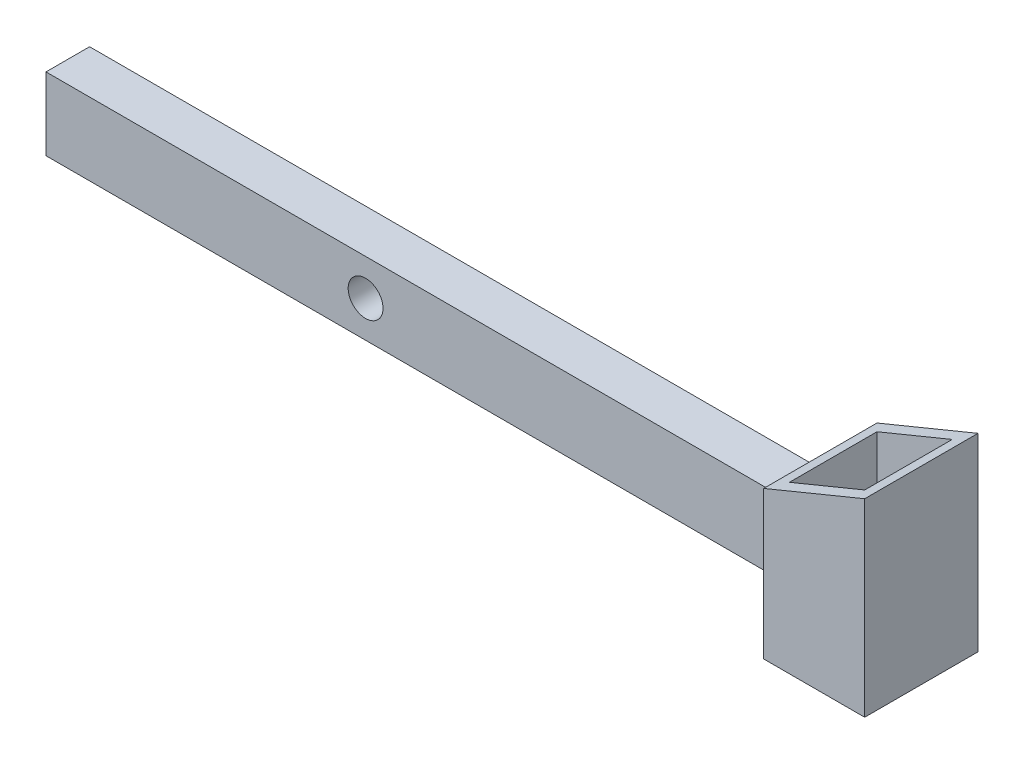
ISO-10303-21;
HEADER;
FILE_DESCRIPTION(('STEP AP214'),'2;1');
FILE_NAME('part.step','',(''),(''),'','','');
FILE_SCHEMA(('AUTOMOTIVE_DESIGN { 1 0 10303 214 1 1 1 1 }'));
ENDSEC;
DATA;
#1=APPLICATION_CONTEXT('core data for automotive mechanical design processes');
#2=APPLICATION_PROTOCOL_DEFINITION('international standard','automotive_design',2000,#1);
#3=PRODUCT_CONTEXT('',#1,'mechanical');
#4=PRODUCT('Part','Part','',(#3));
#5=PRODUCT_RELATED_PRODUCT_CATEGORY('part','',(#4));
#6=PRODUCT_DEFINITION_FORMATION('','',#4);
#7=PRODUCT_DEFINITION_CONTEXT('part definition',#1,'design');
#8=PRODUCT_DEFINITION('design','',#6,#7);
#9=PRODUCT_DEFINITION_SHAPE('','',#8);
#10=(LENGTH_UNIT() NAMED_UNIT(*) SI_UNIT(.MILLI.,.METRE.));
#11=(NAMED_UNIT(*) PLANE_ANGLE_UNIT() SI_UNIT($,.RADIAN.));
#12=(NAMED_UNIT(*) SI_UNIT($,.STERADIAN.) SOLID_ANGLE_UNIT());
#13=UNCERTAINTY_MEASURE_WITH_UNIT(LENGTH_MEASURE(1.E-05),#10,'distance_accuracy_value','');
#14=(GEOMETRIC_REPRESENTATION_CONTEXT(3) GLOBAL_UNCERTAINTY_ASSIGNED_CONTEXT((#13)) GLOBAL_UNIT_ASSIGNED_CONTEXT((#10,
#11,#12)) REPRESENTATION_CONTEXT('',''));
#15=CARTESIAN_POINT('',(0.,0.,0.));
#16=DIRECTION('',(0.,0.,1.));
#17=DIRECTION('',(1.,0.,0.));
#18=AXIS2_PLACEMENT_3D('',#15,#16,#17);
#19=CARTESIAN_POINT('',(-150.,25.985336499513,5.));
#20=DIRECTION('',(0.,0.,1.));
#21=DIRECTION('',(1.,0.,0.));
#22=AXIS2_PLACEMENT_3D('',#19,#20,#21);
#23=CYLINDRICAL_SURFACE('',#22,6.00000000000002);
#24=CARTESIAN_POINT('',(-150.,25.985336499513,25.));
#25=DIRECTION('',(0.,0.,1.));
#26=DIRECTION('',(1.,0.,0.));
#27=AXIS2_PLACEMENT_3D('',#24,#25,#26);
#28=CIRCLE('',#27,6.00000000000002);
#29=CARTESIAN_POINT('',(-144.,25.985336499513,25.));
#30=VERTEX_POINT('',#29);
#31=EDGE_CURVE('E433',#30,#30,#28,.T.);
#32=ORIENTED_EDGE('',*,*,#31,.T.);
#33=EDGE_LOOP('',(#32));
#34=FACE_BOUND('',#33,.T.);
#35=CARTESIAN_POINT('',(-150.,25.985336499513,15.));
#36=DIRECTION('',(0.,0.,-1.));
#37=DIRECTION('',(0.,1.,0.));
#38=AXIS2_PLACEMENT_3D('',#35,#36,#37);
#39=CIRCLE('',#38,6.00000000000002);
#40=CARTESIAN_POINT('',(-150.,31.985336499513,15.));
#41=VERTEX_POINT('',#40);
#42=EDGE_CURVE('E41',#41,#41,#39,.F.);
#43=ORIENTED_EDGE('',*,*,#42,.F.);
#44=EDGE_LOOP('',(#43));
#45=FACE_BOUND('',#44,.T.);
#46=ADVANCED_FACE('F37',(#34,#45),#23,.F.);
#47=CARTESIAN_POINT('',(0.,0.,-0.999999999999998));
#48=DIRECTION('',(-1.,0.,0.));
#49=DIRECTION('',(0.,0.,1.));
#50=AXIS2_PLACEMENT_3D('',#47,#48,#49);
#51=PLANE('',#50);
#52=DIRECTION('',(0.,-1.,0.));
#53=VECTOR('',#52,1.);
#54=CARTESIAN_POINT('',(0.,38.485336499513,10.));
#55=LINE('',#54,#53);
#56=CARTESIAN_POINT('',(0.,38.485336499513,10.));
#57=VERTEX_POINT('',#56);
#58=CARTESIAN_POINT('',(0.,13.485336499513,10.));
#59=VERTEX_POINT('',#58);
#60=EDGE_CURVE('E54',#57,#59,#55,.T.);
#61=ORIENTED_EDGE('',*,*,#60,.F.);
#62=DIRECTION('',(0.,0.,-1.));
#63=VECTOR('',#62,1.);
#64=CARTESIAN_POINT('',(0.,38.485336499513,10.));
#65=LINE('',#64,#63);
#66=CARTESIAN_POINT('',(0.,38.485336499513,25.));
#67=VERTEX_POINT('',#66);
#68=EDGE_CURVE('E58',#67,#57,#65,.T.);
#69=ORIENTED_EDGE('',*,*,#68,.F.);
#70=DIRECTION('',(0.,1.,0.));
#71=VECTOR('',#70,1.);
#72=CARTESIAN_POINT('',(0.,38.485336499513,25.));
#73=LINE('',#72,#71);
#74=CARTESIAN_POINT('',(0.,13.485336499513,25.));
#75=VERTEX_POINT('',#74);
#76=EDGE_CURVE('E447',#75,#67,#73,.T.);
#77=ORIENTED_EDGE('',*,*,#76,.F.);
#78=DIRECTION('',(0.,0.,1.));
#79=VECTOR('',#78,1.);
#80=CARTESIAN_POINT('',(0.,13.485336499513,10.));
#81=LINE('',#80,#79);
#82=EDGE_CURVE('E445',#59,#75,#81,.T.);
#83=ORIENTED_EDGE('',*,*,#82,.F.);
#84=EDGE_LOOP('',(#61,#69,#77,#83));
#85=FACE_BOUND('',#84,.T.);
#86=DIRECTION('',(0.,0.,1.));
#87=VECTOR('',#86,1.);
#88=CARTESIAN_POINT('',(0.,0.,-0.999999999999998));
#89=LINE('',#88,#87);
#90=CARTESIAN_POINT('',(0.,0.,-0.999999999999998));
#91=VERTEX_POINT('',#90);
#92=CARTESIAN_POINT('',(0.,0.,38.));
#93=VERTEX_POINT('',#92);
#94=EDGE_CURVE('E206',#91,#93,#89,.T.);
#95=ORIENTED_EDGE('',*,*,#94,.T.);
#96=DIRECTION('',(0.,-1.,0.));
#97=VECTOR('',#96,1.);
#98=CARTESIAN_POINT('',(0.,0.,38.));
#99=LINE('',#98,#97);
#100=CARTESIAN_POINT('',(0.,50.8308240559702,38.));
#101=VERTEX_POINT('',#100);
#102=EDGE_CURVE('E177',#101,#93,#99,.T.);
#103=ORIENTED_EDGE('',*,*,#102,.F.);
#104=DIRECTION('',(0.,0.,1.));
#105=VECTOR('',#104,1.);
#106=CARTESIAN_POINT('',(0.,50.8308240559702,-0.999999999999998));
#107=LINE('',#106,#105);
#108=CARTESIAN_POINT('',(0.,50.8308240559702,-0.999999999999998));
#109=VERTEX_POINT('',#108);
#110=EDGE_CURVE('E11',#109,#101,#107,.T.);
#111=ORIENTED_EDGE('',*,*,#110,.F.);
#112=DIRECTION('',(0.,-1.,0.));
#113=VECTOR('',#112,1.);
#114=CARTESIAN_POINT('',(0.,0.,-0.999999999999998));
#115=LINE('',#114,#113);
#116=EDGE_CURVE('E195',#109,#91,#115,.T.);
#117=ORIENTED_EDGE('',*,*,#116,.T.);
#118=EDGE_LOOP('',(#95,#103,#111,#117));
#119=FACE_BOUND('',#118,.T.);
#120=ADVANCED_FACE('F39',(#85,#119),#51,.T.);
#121=CARTESIAN_POINT('',(0.,50.8308240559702,-0.999999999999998));
#122=DIRECTION('',(-0.380607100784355,0.924736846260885,0.));
#123=DIRECTION('',(-0.924736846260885,-0.380607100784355,0.));
#124=AXIS2_PLACEMENT_3D('',#121,#122,#123);
#125=PLANE('',#124);
#126=DIRECTION('',(0.,0.,1.));
#127=VECTOR('',#126,1.);
#128=CARTESIAN_POINT('',(4.42934661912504,52.6538732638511,-0.999999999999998));
#129=LINE('',#128,#127);
#130=CARTESIAN_POINT('',(4.42934661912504,52.6538732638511,3.42934661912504));
#131=VERTEX_POINT('',#130);
#132=CARTESIAN_POINT('',(4.42934661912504,52.6538732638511,33.5706533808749));
#133=VERTEX_POINT('',#132);
#134=EDGE_CURVE('E175',#131,#133,#129,.T.);
#135=ORIENTED_EDGE('',*,*,#134,.F.);
#136=DIRECTION('',(-0.924736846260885,-0.380607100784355,0.));
#137=VECTOR('',#136,1.);
#138=CARTESIAN_POINT('',(0.,50.8308240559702,3.42934661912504));
#139=LINE('',#138,#137);
#140=CARTESIAN_POINT('',(30.3397418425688,63.3181832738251,3.42934661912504));
#141=VERTEX_POINT('',#140);
#142=EDGE_CURVE('E158',#141,#131,#139,.T.);
#143=ORIENTED_EDGE('',*,*,#142,.F.);
#144=DIRECTION('',(0.,0.,1.));
#145=VECTOR('',#144,1.);
#146=CARTESIAN_POINT('',(30.3397418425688,63.3181832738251,-0.999999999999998));
#147=LINE('',#146,#145);
#148=CARTESIAN_POINT('',(30.3397418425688,63.3181832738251,33.5706533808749));
#149=VERTEX_POINT('',#148);
#150=EDGE_CURVE('E166',#141,#149,#147,.T.);
#151=ORIENTED_EDGE('',*,*,#150,.T.);
#152=DIRECTION('',(-0.924736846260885,-0.380607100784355,0.));
#153=VECTOR('',#152,1.);
#154=CARTESIAN_POINT('',(0.,50.8308240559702,33.5706533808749));
#155=LINE('',#154,#153);
#156=EDGE_CURVE('E164',#149,#133,#155,.T.);
#157=ORIENTED_EDGE('',*,*,#156,.T.);
#158=EDGE_LOOP('',(#135,#143,#151,#157));
#159=FACE_BOUND('',#158,.T.);
#160=ORIENTED_EDGE('',*,*,#110,.T.);
#161=DIRECTION('',(-0.924736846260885,-0.380607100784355,0.));
#162=VECTOR('',#161,1.);
#163=CARTESIAN_POINT('',(0.,50.8308240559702,38.));
#164=LINE('',#163,#162);
#165=CARTESIAN_POINT('',(34.7690884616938,65.1412324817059,38.));
#166=VERTEX_POINT('',#165);
#167=EDGE_CURVE('E192',#166,#101,#164,.T.);
#168=ORIENTED_EDGE('',*,*,#167,.F.);
#169=DIRECTION('',(0.,0.,1.));
#170=VECTOR('',#169,1.);
#171=CARTESIAN_POINT('',(34.7690884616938,65.1412324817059,-0.999999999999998));
#172=LINE('',#171,#170);
#173=CARTESIAN_POINT('',(34.7690884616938,65.1412324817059,-0.999999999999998));
#174=VERTEX_POINT('',#173);
#175=EDGE_CURVE('E46',#174,#166,#172,.T.);
#176=ORIENTED_EDGE('',*,*,#175,.F.);
#177=DIRECTION('',(-0.924736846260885,-0.380607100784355,0.));
#178=VECTOR('',#177,1.);
#179=CARTESIAN_POINT('',(0.,50.8308240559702,-0.999999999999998));
#180=LINE('',#179,#178);
#181=EDGE_CURVE('E204',#174,#109,#180,.T.);
#182=ORIENTED_EDGE('',*,*,#181,.T.);
#183=EDGE_LOOP('',(#160,#168,#176,#182));
#184=FACE_BOUND('',#183,.T.);
#185=ADVANCED_FACE('F222',(#159,#184),#125,.T.);
#186=CARTESIAN_POINT('',(34.7690884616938,0.,-0.999999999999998));
#187=DIRECTION('',(1.,0.,0.));
#188=DIRECTION('',(0.,0.,-1.));
#189=AXIS2_PLACEMENT_3D('',#186,#187,#188);
#190=PLANE('',#189);
#191=ORIENTED_EDGE('',*,*,#175,.T.);
#192=DIRECTION('',(0.,1.,0.));
#193=VECTOR('',#192,1.);
#194=CARTESIAN_POINT('',(34.7690884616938,0.,38.));
#195=LINE('',#194,#193);
#196=CARTESIAN_POINT('',(34.7690884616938,0.,38.));
#197=VERTEX_POINT('',#196);
#198=EDGE_CURVE('E189',#197,#166,#195,.T.);
#199=ORIENTED_EDGE('',*,*,#198,.F.);
#200=DIRECTION('',(0.,0.,1.));
#201=VECTOR('',#200,1.);
#202=CARTESIAN_POINT('',(34.7690884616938,0.,-0.999999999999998));
#203=LINE('',#202,#201);
#204=CARTESIAN_POINT('',(34.7690884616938,0.,-0.999999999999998));
#205=VERTEX_POINT('',#204);
#206=EDGE_CURVE('E209',#205,#197,#203,.T.);
#207=ORIENTED_EDGE('',*,*,#206,.F.);
#208=DIRECTION('',(0.,1.,0.));
#209=VECTOR('',#208,1.);
#210=CARTESIAN_POINT('',(34.7690884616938,0.,-0.999999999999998));
#211=LINE('',#210,#209);
#212=EDGE_CURVE('E201',#205,#174,#211,.T.);
#213=ORIENTED_EDGE('',*,*,#212,.T.);
#214=EDGE_LOOP('',(#191,#199,#207,#213));
#215=FACE_BOUND('',#214,.T.);
#216=ADVANCED_FACE('F228',(#215),#190,.T.);
#217=CARTESIAN_POINT('',(0.,0.,-0.999999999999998));
#218=DIRECTION('',(0.,-1.,0.));
#219=DIRECTION('',(0.,0.,-1.));
#220=AXIS2_PLACEMENT_3D('',#217,#218,#219);
#221=PLANE('',#220);
#222=ORIENTED_EDGE('',*,*,#206,.T.);
#223=DIRECTION('',(1.,0.,0.));
#224=VECTOR('',#223,1.);
#225=CARTESIAN_POINT('',(0.,0.,38.));
#226=LINE('',#225,#224);
#227=EDGE_CURVE('E186',#93,#197,#226,.T.);
#228=ORIENTED_EDGE('',*,*,#227,.F.);
#229=ORIENTED_EDGE('',*,*,#94,.F.);
#230=DIRECTION('',(1.,0.,0.));
#231=VECTOR('',#230,1.);
#232=CARTESIAN_POINT('',(0.,0.,-0.999999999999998));
#233=LINE('',#232,#231);
#234=EDGE_CURVE('E198',#91,#205,#233,.T.);
#235=ORIENTED_EDGE('',*,*,#234,.T.);
#236=EDGE_LOOP('',(#222,#228,#229,#235));
#237=FACE_BOUND('',#236,.T.);
#238=ADVANCED_FACE('F216',(#237),#221,.T.);
#239=CARTESIAN_POINT('',(0.,0.,-0.999999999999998));
#240=DIRECTION('',(0.,0.,-1.));
#241=DIRECTION('',(-1.,0.,0.));
#242=AXIS2_PLACEMENT_3D('',#239,#240,#241);
#243=PLANE('',#242);
#244=ORIENTED_EDGE('',*,*,#116,.F.);
#245=ORIENTED_EDGE('',*,*,#181,.F.);
#246=ORIENTED_EDGE('',*,*,#212,.F.);
#247=ORIENTED_EDGE('',*,*,#234,.F.);
#248=EDGE_LOOP('',(#244,#245,#246,#247));
#249=FACE_BOUND('',#248,.T.);
#250=ADVANCED_FACE('F225',(#249),#243,.T.);
#251=CARTESIAN_POINT('',(0.,0.,38.));
#252=DIRECTION('',(0.,0.,-1.));
#253=DIRECTION('',(-1.,0.,0.));
#254=AXIS2_PLACEMENT_3D('',#251,#252,#253);
#255=PLANE('',#254);
#256=ORIENTED_EDGE('',*,*,#102,.T.);
#257=ORIENTED_EDGE('',*,*,#227,.T.);
#258=ORIENTED_EDGE('',*,*,#198,.T.);
#259=ORIENTED_EDGE('',*,*,#167,.T.);
#260=EDGE_LOOP('',(#256,#257,#258,#259));
#261=FACE_BOUND('',#260,.T.);
#262=ADVANCED_FACE('F219',(#261),#255,.F.);
#263=CARTESIAN_POINT('',(4.42934661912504,0.,-0.999999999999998));
#264=DIRECTION('',(-1.,0.,0.));
#265=DIRECTION('',(0.,0.,1.));
#266=AXIS2_PLACEMENT_3D('',#263,#264,#265);
#267=PLANE('',#266);
#268=DIRECTION('',(0.,0.,1.));
#269=VECTOR('',#268,1.);
#270=CARTESIAN_POINT('',(4.42934661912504,4.42934661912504,-0.999999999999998));
#271=LINE('',#270,#269);
#272=CARTESIAN_POINT('',(4.42934661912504,4.42934661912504,3.42934661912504));
#273=VERTEX_POINT('',#272);
#274=CARTESIAN_POINT('',(4.42934661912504,4.42934661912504,33.5706533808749));
#275=VERTEX_POINT('',#274);
#276=EDGE_CURVE('E156',#273,#275,#271,.T.);
#277=ORIENTED_EDGE('',*,*,#276,.F.);
#278=DIRECTION('',(0.,-1.,0.));
#279=VECTOR('',#278,1.);
#280=CARTESIAN_POINT('',(4.42934661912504,0.,3.42934661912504));
#281=LINE('',#280,#279);
#282=EDGE_CURVE('E160',#131,#273,#281,.T.);
#283=ORIENTED_EDGE('',*,*,#282,.F.);
#284=ORIENTED_EDGE('',*,*,#134,.T.);
#285=DIRECTION('',(0.,-1.,0.));
#286=VECTOR('',#285,1.);
#287=CARTESIAN_POINT('',(4.42934661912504,0.,33.5706533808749));
#288=LINE('',#287,#286);
#289=EDGE_CURVE('E147',#133,#275,#288,.T.);
#290=ORIENTED_EDGE('',*,*,#289,.T.);
#291=EDGE_LOOP('',(#277,#283,#284,#290));
#292=FACE_BOUND('',#291,.T.);
#293=ADVANCED_FACE('F275',(#292),#267,.F.);
#294=CARTESIAN_POINT('',(30.3397418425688,0.,-0.999999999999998));
#295=DIRECTION('',(1.,0.,0.));
#296=DIRECTION('',(0.,0.,-1.));
#297=AXIS2_PLACEMENT_3D('',#294,#295,#296);
#298=PLANE('',#297);
#299=ORIENTED_EDGE('',*,*,#150,.F.);
#300=DIRECTION('',(0.,1.,0.));
#301=VECTOR('',#300,1.);
#302=CARTESIAN_POINT('',(30.3397418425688,0.,3.42934661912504));
#303=LINE('',#302,#301);
#304=CARTESIAN_POINT('',(30.3397418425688,4.42934661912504,3.42934661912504));
#305=VERTEX_POINT('',#304);
#306=EDGE_CURVE('E172',#305,#141,#303,.T.);
#307=ORIENTED_EDGE('',*,*,#306,.F.);
#308=DIRECTION('',(0.,0.,1.));
#309=VECTOR('',#308,1.);
#310=CARTESIAN_POINT('',(30.3397418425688,4.42934661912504,-0.999999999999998));
#311=LINE('',#310,#309);
#312=CARTESIAN_POINT('',(30.3397418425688,4.42934661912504,33.5706533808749));
#313=VERTEX_POINT('',#312);
#314=EDGE_CURVE('E157',#305,#313,#311,.T.);
#315=ORIENTED_EDGE('',*,*,#314,.T.);
#316=DIRECTION('',(0.,1.,0.));
#317=VECTOR('',#316,1.);
#318=CARTESIAN_POINT('',(30.3397418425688,0.,33.5706533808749));
#319=LINE('',#318,#317);
#320=EDGE_CURVE('E169',#313,#149,#319,.T.);
#321=ORIENTED_EDGE('',*,*,#320,.T.);
#322=EDGE_LOOP('',(#299,#307,#315,#321));
#323=FACE_BOUND('',#322,.T.);
#324=ADVANCED_FACE('F278',(#323),#298,.F.);
#325=CARTESIAN_POINT('',(0.,4.42934661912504,-0.999999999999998));
#326=DIRECTION('',(0.,-1.,0.));
#327=DIRECTION('',(0.,0.,-1.));
#328=AXIS2_PLACEMENT_3D('',#325,#326,#327);
#329=PLANE('',#328);
#330=ORIENTED_EDGE('',*,*,#314,.F.);
#331=DIRECTION('',(1.,0.,0.));
#332=VECTOR('',#331,1.);
#333=CARTESIAN_POINT('',(0.,4.42934661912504,3.42934661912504));
#334=LINE('',#333,#332);
#335=EDGE_CURVE('E163',#273,#305,#334,.T.);
#336=ORIENTED_EDGE('',*,*,#335,.F.);
#337=ORIENTED_EDGE('',*,*,#276,.T.);
#338=DIRECTION('',(1.,0.,0.));
#339=VECTOR('',#338,1.);
#340=CARTESIAN_POINT('',(0.,4.42934661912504,33.5706533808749));
#341=LINE('',#340,#339);
#342=EDGE_CURVE('E150',#275,#313,#341,.T.);
#343=ORIENTED_EDGE('',*,*,#342,.T.);
#344=EDGE_LOOP('',(#330,#336,#337,#343));
#345=FACE_BOUND('',#344,.T.);
#346=ADVANCED_FACE('F282',(#345),#329,.F.);
#347=CARTESIAN_POINT('',(0.,0.,3.42934661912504));
#348=DIRECTION('',(0.,0.,-1.));
#349=DIRECTION('',(-1.,0.,0.));
#350=AXIS2_PLACEMENT_3D('',#347,#348,#349);
#351=PLANE('',#350);
#352=ORIENTED_EDGE('',*,*,#282,.T.);
#353=ORIENTED_EDGE('',*,*,#335,.T.);
#354=ORIENTED_EDGE('',*,*,#306,.T.);
#355=ORIENTED_EDGE('',*,*,#142,.T.);
#356=EDGE_LOOP('',(#352,#353,#354,#355));
#357=FACE_BOUND('',#356,.T.);
#358=ADVANCED_FACE('F286',(#357),#351,.F.);
#359=CARTESIAN_POINT('',(0.,0.,33.5706533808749));
#360=DIRECTION('',(0.,0.,-1.));
#361=DIRECTION('',(-1.,0.,0.));
#362=AXIS2_PLACEMENT_3D('',#359,#360,#361);
#363=PLANE('',#362);
#364=ORIENTED_EDGE('',*,*,#289,.F.);
#365=ORIENTED_EDGE('',*,*,#156,.F.);
#366=ORIENTED_EDGE('',*,*,#320,.F.);
#367=ORIENTED_EDGE('',*,*,#342,.F.);
#368=EDGE_LOOP('',(#364,#365,#366,#367));
#369=FACE_BOUND('',#368,.T.);
#370=ADVANCED_FACE('F273',(#369),#363,.T.);
#371=CARTESIAN_POINT('',(-260.,38.485336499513,10.));
#372=DIRECTION('',(0.,0.,1.));
#373=DIRECTION('',(0.,-1.,0.));
#374=AXIS2_PLACEMENT_3D('',#371,#372,#373);
#375=PLANE('',#374);
#376=CARTESIAN_POINT('',(-150.,25.985336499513,10.));
#377=DIRECTION('',(0.,0.,-1.));
#378=DIRECTION('',(0.,1.,0.));
#379=AXIS2_PLACEMENT_3D('',#376,#377,#378);
#380=CIRCLE('',#379,9.00000000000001);
#381=CARTESIAN_POINT('',(-150.,34.985336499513,10.));
#382=VERTEX_POINT('',#381);
#383=EDGE_CURVE('E429',#382,#382,#380,.T.);
#384=ORIENTED_EDGE('',*,*,#383,.F.);
#385=EDGE_LOOP('',(#384));
#386=FACE_BOUND('',#385,.T.);
#387=ORIENTED_EDGE('',*,*,#60,.T.);
#388=DIRECTION('',(1.,0.,0.));
#389=VECTOR('',#388,1.);
#390=CARTESIAN_POINT('',(-260.,13.485336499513,10.));
#391=LINE('',#390,#389);
#392=CARTESIAN_POINT('',(-260.,13.485336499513,10.));
#393=VERTEX_POINT('',#392);
#394=EDGE_CURVE('E130',#393,#59,#391,.T.);
#395=ORIENTED_EDGE('',*,*,#394,.F.);
#396=DIRECTION('',(0.,-1.,0.));
#397=VECTOR('',#396,1.);
#398=CARTESIAN_POINT('',(-260.,38.485336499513,10.));
#399=LINE('',#398,#397);
#400=CARTESIAN_POINT('',(-260.,38.485336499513,10.));
#401=VERTEX_POINT('',#400);
#402=EDGE_CURVE('E136',#401,#393,#399,.T.);
#403=ORIENTED_EDGE('',*,*,#402,.F.);
#404=DIRECTION('',(1.,0.,0.));
#405=VECTOR('',#404,1.);
#406=CARTESIAN_POINT('',(-260.,38.485336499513,10.));
#407=LINE('',#406,#405);
#408=EDGE_CURVE('E443',#401,#57,#407,.T.);
#409=ORIENTED_EDGE('',*,*,#408,.T.);
#410=EDGE_LOOP('',(#387,#395,#403,#409));
#411=FACE_BOUND('',#410,.T.);
#412=ADVANCED_FACE('F146',(#386,#411),#375,.F.);
#413=CARTESIAN_POINT('',(-260.,13.485336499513,10.));
#414=DIRECTION('',(0.,1.,0.));
#415=DIRECTION('',(-1.,0.,0.));
#416=AXIS2_PLACEMENT_3D('',#413,#414,#415);
#417=PLANE('',#416);
#418=ORIENTED_EDGE('',*,*,#82,.T.);
#419=DIRECTION('',(1.,0.,0.));
#420=VECTOR('',#419,1.);
#421=CARTESIAN_POINT('',(-260.,13.485336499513,25.));
#422=LINE('',#421,#420);
#423=CARTESIAN_POINT('',(-260.,13.485336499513,25.));
#424=VERTEX_POINT('',#423);
#425=EDGE_CURVE('E132',#424,#75,#422,.T.);
#426=ORIENTED_EDGE('',*,*,#425,.F.);
#427=DIRECTION('',(0.,0.,1.));
#428=VECTOR('',#427,1.);
#429=CARTESIAN_POINT('',(-260.,13.485336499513,10.));
#430=LINE('',#429,#428);
#431=EDGE_CURVE('E125',#393,#424,#430,.T.);
#432=ORIENTED_EDGE('',*,*,#431,.F.);
#433=ORIENTED_EDGE('',*,*,#394,.T.);
#434=EDGE_LOOP('',(#418,#426,#432,#433));
#435=FACE_BOUND('',#434,.T.);
#436=ADVANCED_FACE('F128',(#435),#417,.F.);
#437=CARTESIAN_POINT('',(-260.,38.485336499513,25.));
#438=DIRECTION('',(0.,0.,-1.));
#439=DIRECTION('',(0.,1.,0.));
#440=AXIS2_PLACEMENT_3D('',#437,#438,#439);
#441=PLANE('',#440);
#442=ORIENTED_EDGE('',*,*,#31,.F.);
#443=EDGE_LOOP('',(#442));
#444=FACE_BOUND('',#443,.T.);
#445=ORIENTED_EDGE('',*,*,#76,.T.);
#446=DIRECTION('',(1.,0.,0.));
#447=VECTOR('',#446,1.);
#448=CARTESIAN_POINT('',(-260.,38.485336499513,25.));
#449=LINE('',#448,#447);
#450=CARTESIAN_POINT('',(-260.,38.485336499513,25.));
#451=VERTEX_POINT('',#450);
#452=EDGE_CURVE('E152',#451,#67,#449,.T.);
#453=ORIENTED_EDGE('',*,*,#452,.F.);
#454=DIRECTION('',(0.,1.,0.));
#455=VECTOR('',#454,1.);
#456=CARTESIAN_POINT('',(-260.,38.485336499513,25.));
#457=LINE('',#456,#455);
#458=EDGE_CURVE('E135',#424,#451,#457,.T.);
#459=ORIENTED_EDGE('',*,*,#458,.F.);
#460=ORIENTED_EDGE('',*,*,#425,.T.);
#461=EDGE_LOOP('',(#445,#453,#459,#460));
#462=FACE_BOUND('',#461,.T.);
#463=ADVANCED_FACE('F264',(#444,#462),#441,.F.);
#464=CARTESIAN_POINT('',(-260.,38.485336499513,10.));
#465=DIRECTION('',(0.,-1.,0.));
#466=DIRECTION('',(1.,0.,0.));
#467=AXIS2_PLACEMENT_3D('',#464,#465,#466);
#468=PLANE('',#467);
#469=ORIENTED_EDGE('',*,*,#68,.T.);
#470=ORIENTED_EDGE('',*,*,#408,.F.);
#471=DIRECTION('',(0.,0.,-1.));
#472=VECTOR('',#471,1.);
#473=CARTESIAN_POINT('',(-260.,38.485336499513,10.));
#474=LINE('',#473,#472);
#475=EDGE_CURVE('E141',#451,#401,#474,.T.);
#476=ORIENTED_EDGE('',*,*,#475,.F.);
#477=ORIENTED_EDGE('',*,*,#452,.T.);
#478=EDGE_LOOP('',(#469,#470,#476,#477));
#479=FACE_BOUND('',#478,.T.);
#480=ADVANCED_FACE('F260',(#479),#468,.F.);
#481=CARTESIAN_POINT('',(-260.,0.,0.));
#482=DIRECTION('',(-1.,0.,0.));
#483=DIRECTION('',(0.,-1.,0.));
#484=AXIS2_PLACEMENT_3D('',#481,#482,#483);
#485=PLANE('',#484);
#486=CARTESIAN_POINT('',(-260.,25.985336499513,17.5));
#487=DIRECTION('',(-1.,0.,0.));
#488=DIRECTION('',(0.,-1.,0.));
#489=AXIS2_PLACEMENT_3D('',#486,#487,#488);
#490=CIRCLE('',#489,6.00000000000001);
#491=CARTESIAN_POINT('',(-260.,19.985336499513,17.5));
#492=VERTEX_POINT('',#491);
#493=EDGE_CURVE('E435',#492,#492,#490,.T.);
#494=ORIENTED_EDGE('',*,*,#493,.F.);
#495=EDGE_LOOP('',(#494));
#496=FACE_BOUND('',#495,.T.);
#497=ORIENTED_EDGE('',*,*,#402,.T.);
#498=ORIENTED_EDGE('',*,*,#431,.T.);
#499=ORIENTED_EDGE('',*,*,#458,.T.);
#500=ORIENTED_EDGE('',*,*,#475,.T.);
#501=EDGE_LOOP('',(#497,#498,#499,#500));
#502=FACE_BOUND('',#501,.T.);
#503=ADVANCED_FACE('F139',(#496,#502),#485,.T.);
#504=CARTESIAN_POINT('',(-210.,25.985336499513,17.5));
#505=DIRECTION('',(-1.,0.,0.));
#506=DIRECTION('',(0.,-1.,0.));
#507=AXIS2_PLACEMENT_3D('',#504,#505,#506);
#508=CYLINDRICAL_SURFACE('',#507,6.00000000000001);
#509=CARTESIAN_POINT('',(-210.,25.985336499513,17.5));
#510=DIRECTION('',(-1.,0.,0.));
#511=DIRECTION('',(0.,-1.,0.));
#512=AXIS2_PLACEMENT_3D('',#509,#510,#511);
#513=CIRCLE('',#512,6.00000000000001);
#514=CARTESIAN_POINT('',(-210.,19.985336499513,17.5));
#515=VERTEX_POINT('',#514);
#516=EDGE_CURVE('E436',#515,#515,#513,.T.);
#517=ORIENTED_EDGE('',*,*,#516,.F.);
#518=EDGE_LOOP('',(#517));
#519=FACE_BOUND('',#518,.T.);
#520=ORIENTED_EDGE('',*,*,#493,.T.);
#521=EDGE_LOOP('',(#520));
#522=FACE_BOUND('',#521,.T.);
#523=ADVANCED_FACE('F253',(#519,#522),#508,.F.);
#524=CARTESIAN_POINT('',(-210.,25.985336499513,17.5));
#525=DIRECTION('',(-1.,0.,0.));
#526=DIRECTION('',(0.,-1.,0.));
#527=AXIS2_PLACEMENT_3D('',#524,#525,#526);
#528=PLANE('',#527);
#529=ORIENTED_EDGE('',*,*,#516,.T.);
#530=EDGE_LOOP('',(#529));
#531=FACE_BOUND('',#530,.T.);
#532=ADVANCED_FACE('F249',(#531),#528,.T.);
#533=CARTESIAN_POINT('',(-150.,25.985336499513,15.));
#534=DIRECTION('',(0.,0.,-1.));
#535=DIRECTION('',(0.,1.,0.));
#536=AXIS2_PLACEMENT_3D('',#533,#534,#535);
#537=PLANE('',#536);
#538=CARTESIAN_POINT('',(-150.,25.985336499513,15.));
#539=DIRECTION('',(0.,0.,-1.));
#540=DIRECTION('',(0.,1.,0.));
#541=AXIS2_PLACEMENT_3D('',#538,#539,#540);
#542=CIRCLE('',#541,9.00000000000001);
#543=CARTESIAN_POINT('',(-150.,34.985336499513,15.));
#544=VERTEX_POINT('',#543);
#545=EDGE_CURVE('E426',#544,#544,#542,.T.);
#546=ORIENTED_EDGE('',*,*,#545,.T.);
#547=EDGE_LOOP('',(#546));
#548=FACE_BOUND('',#547,.T.);
#549=ORIENTED_EDGE('',*,*,#42,.T.);
#550=EDGE_LOOP('',(#549));
#551=FACE_BOUND('',#550,.T.);
#552=ADVANCED_FACE('F252',(#548,#551),#537,.T.);
#553=CARTESIAN_POINT('',(-150.,25.985336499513,15.));
#554=DIRECTION('',(0.,0.,-1.));
#555=DIRECTION('',(0.,1.,0.));
#556=AXIS2_PLACEMENT_3D('',#553,#554,#555);
#557=CYLINDRICAL_SURFACE('',#556,9.00000000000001);
#558=ORIENTED_EDGE('',*,*,#545,.F.);
#559=EDGE_LOOP('',(#558));
#560=FACE_BOUND('',#559,.T.);
#561=ORIENTED_EDGE('',*,*,#383,.T.);
#562=EDGE_LOOP('',(#561));
#563=FACE_BOUND('',#562,.T.);
#564=ADVANCED_FACE('F247',(#560,#563),#557,.F.);
#565=CLOSED_SHELL('',(#46,#120,#185,#216,#238,#250,#262,#293,#324,#346,#358,#370,#412,#436,#463,
#480,#503,#523,#532,#552,#564));
#566=MANIFOLD_SOLID_BREP('B2',#565);
#567=ADVANCED_BREP_SHAPE_REPRESENTATION('',(#18,#566),#14);
#568=SHAPE_DEFINITION_REPRESENTATION(#9,#567);
ENDSEC;
END-ISO-10303-21;
